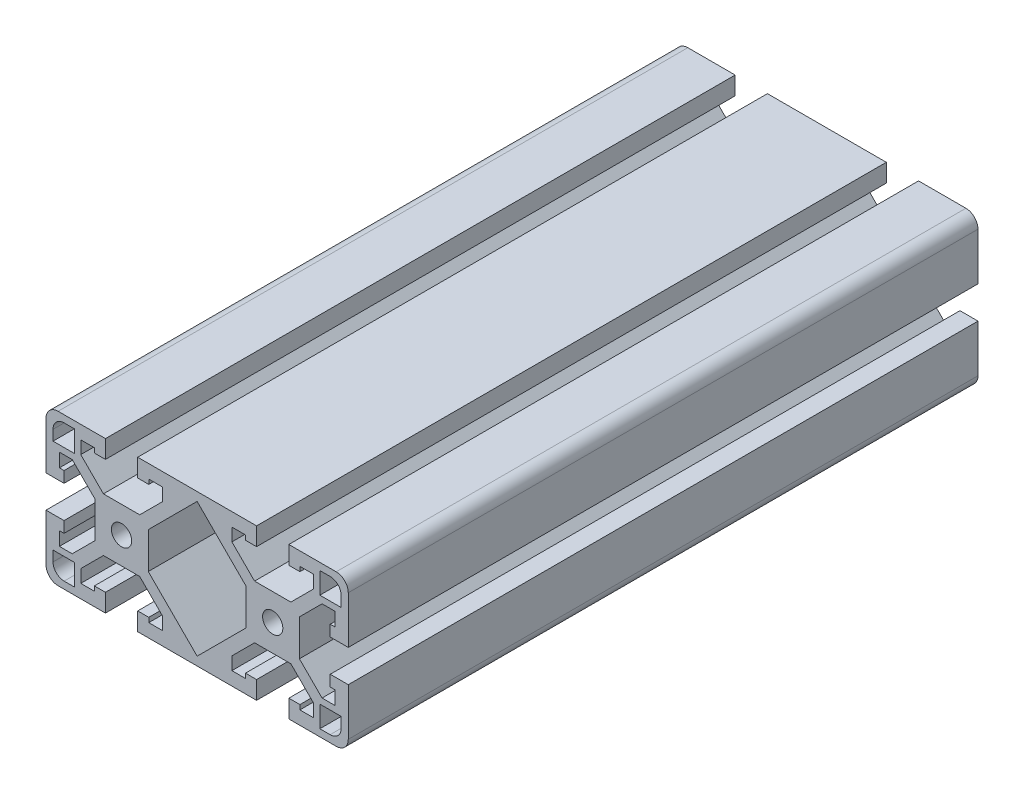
from build123d import *

# Parameters (mm, degrees)
SKETCH1_R           = 2.5527
BOSS_EXTRUDE1_DEPTH = 79.375


with BuildPart() as part:
    # Sketch1 → Boss-Extrude1 (new, symmetric)
    with BuildSketch(Plane.XY):
        with BuildLine():
            Line((-29.337, 12.442261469), (-29.337, 15.6718))
            Line((-29.337, 15.6718), (-25.908, 15.6718))
            Line((-25.908, 15.6718), (-25.908, 14.5034))
            Line((-25.908, 14.5034), (-23.114, 14.5034))
            Line((-23.114, 14.5034), (-23.114, 19.05))
            Line((-23.114, 19.05), (-35.052, 19.05))
            ThreePointArc((-35.052, 19.05), (-37.207261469, 18.157261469), (-38.1, 16.002))
            Line((-38.1, 16.002), (-38.1, 4.064))
            Line((-38.1, 4.064), (-33.5534, 4.064))
            Line((-33.5534, 4.064), (-33.5534, 6.858))
            Line((-33.5534, 6.858), (-34.7218, 6.858))
            Line((-34.7218, 6.858), (-34.7218, 10.287))
            Line((-34.7218, 10.287), (-31.492261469, 10.287))
            Line((-31.492261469, 10.287), (-25.781, 4.575738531))
            Line((-25.781, 4.575738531), (-25.781, -4.575738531))
            Line((-25.781, -4.575738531), (-31.492261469, -10.287))
            Line((-31.492261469, -10.287), (-34.7218, -10.287))
            Line((-34.7218, -10.287), (-34.7218, -6.858))
            Line((-34.7218, -6.858), (-33.5534, -6.858))
            Line((-33.5534, -6.858), (-33.5534, -4.064))
            Line((-33.5534, -4.064), (-38.1, -4.064))
            Line((-38.1, -4.064), (-38.1, -16.002))
            ThreePointArc((-38.1, -16.002), (-37.207261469, -18.157261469), (-35.052, -19.05))
            Line((-35.052, -19.05), (-23.114, -19.05))
            Line((-23.114, -19.05), (-23.114, -14.5034))
            Line((-23.114, -14.5034), (-25.908, -14.5034))
            Line((-25.908, -14.5034), (-25.908, -15.6718))
            Line((-25.908, -15.6718), (-29.337, -15.6718))
            Line((-29.337, -15.6718), (-29.337, -12.442261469))
            Line((-29.337, -12.442261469), (-23.625738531, -6.731))
            Line((-23.625738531, -6.731), (-14.474261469, -6.731))
            Line((-14.474261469, -6.731), (-8.763, -12.442261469))
            Line((-8.763, -12.442261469), (-8.763, -15.6718))
            Line((-8.763, -15.6718), (-12.192, -15.6718))
            Line((-12.192, -15.6718), (-12.192, -14.5034))
            Line((-12.192, -14.5034), (-14.986, -14.5034))
            Line((-14.986, -14.5034), (-14.986, -19.05))
            Line((-14.986, -19.05), (14.986, -19.05))
            Line((14.986, -19.05), (14.986, -14.5034))
            Line((14.986, -14.5034), (12.192, -14.5034))
            Line((12.192, -14.5034), (12.192, -15.6718))
            Line((12.192, -15.6718), (8.763, -15.6718))
            Line((8.763, -15.6718), (8.763, -12.442261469))
            Line((8.763, -12.442261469), (14.474261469, -6.731))
            Line((14.474261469, -6.731), (23.625738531, -6.731))
            Line((23.625738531, -6.731), (29.337, -12.442261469))
            Line((29.337, -12.442261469), (29.337, -15.6718))
            Line((29.337, -15.6718), (25.908, -15.6718))
            Line((25.908, -15.6718), (25.908, -14.5034))
            Line((25.908, -14.5034), (23.114, -14.5034))
            Line((23.114, -14.5034), (23.114, -19.05))
            Line((23.114, -19.05), (35.052, -19.05))
            ThreePointArc((35.052, -19.05), (37.207261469, -18.157261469), (38.1, -16.002))
            Line((38.1, -16.002), (38.1, -4.064))
            Line((38.1, -4.064), (33.5534, -4.064))
            Line((33.5534, -4.064), (33.5534, -6.858))
            Line((33.5534, -6.858), (34.7218, -6.858))
            Line((34.7218, -6.858), (34.7218, -10.287))
            Line((34.7218, -10.287), (31.492261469, -10.287))
            Line((31.492261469, -10.287), (25.781, -4.575738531))
            Line((25.781, -4.575738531), (25.781, 4.575738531))
            Line((25.781, 4.575738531), (31.492261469, 10.287))
            Line((31.492261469, 10.287), (34.7218, 10.287))
            Line((34.7218, 10.287), (34.7218, 6.858))
            Line((34.7218, 6.858), (33.5534, 6.858))
            Line((33.5534, 6.858), (33.5534, 4.064))
            Line((33.5534, 4.064), (38.1, 4.064))
            Line((38.1, 4.064), (38.1, 16.002))
            ThreePointArc((38.1, 16.002), (37.207261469, 18.157261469), (35.052, 19.05))
            Line((35.052, 19.05), (23.114, 19.05))
            Line((23.114, 19.05), (23.114, 14.5034))
            Line((23.114, 14.5034), (25.908, 14.5034))
            Line((25.908, 14.5034), (25.908, 15.6718))
            Line((25.908, 15.6718), (29.337, 15.6718))
            Line((29.337, 15.6718), (29.337, 12.442261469))
            Line((29.337, 12.442261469), (23.625738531, 6.731))
            Line((23.625738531, 6.731), (14.474261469, 6.731))
            Line((14.474261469, 6.731), (8.763, 12.442261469))
            Line((8.763, 12.442261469), (8.763, 15.6718))
            Line((8.763, 15.6718), (12.192, 15.6718))
            Line((12.192, 15.6718), (12.192, 14.5034))
            Line((12.192, 14.5034), (14.986, 14.5034))
            Line((14.986, 14.5034), (14.986, 19.05))
            Line((14.986, 19.05), (-14.986, 19.05))
            Line((-14.986, 19.05), (-14.986, 14.5034))
            Line((-14.986, 14.5034), (-12.192, 14.5034))
            Line((-12.192, 14.5034), (-12.192, 15.6718))
            Line((-12.192, 15.6718), (-8.763, 15.6718))
            Line((-8.763, 15.6718), (-8.763, 12.442261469))
            Line((-8.763, 12.442261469), (-14.474261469, 6.731))
            Line((-14.474261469, 6.731), (-23.625738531, 6.731))
            Line((-23.625738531, 6.731), (-29.337, 12.442261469))
        make_face()
        with Locations(Location((-19.05, 0, 0), (0, 0, 180))):
            Circle(SKETCH1_R, mode=Mode.SUBTRACT)
        with Locations(Location((19.05, 0, 0), (0, 0, 180))):
            Circle(SKETCH1_R, mode=Mode.SUBTRACT)
        Polygon((-12.319, 4.575738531), (-12.319, -4.575738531), (0, -16.894738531), (12.319, -4.575738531), (12.319, 4.575738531), (0, 16.894738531), align=None, mode=Mode.SUBTRACT)
        with BuildLine():
            Line((-30.9372, 11.8872), (-30.9372, 17.272))
            Line((-30.9372, 17.272), (-33.528, 17.272))
            ThreePointArc((-33.528, 17.272), (-35.503656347, 16.453656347), (-36.322, 14.478))
            Line((-36.322, 14.478), (-36.322, 11.8872))
            Line((-36.322, 11.8872), (-30.9372, 11.8872))
        make_face(mode=Mode.SUBTRACT)
        with BuildLine():
            Line((-30.9372, -17.272), (-30.9372, -11.8872))
            Line((-30.9372, -11.8872), (-36.322, -11.8872))
            Line((-36.322, -11.8872), (-36.322, -14.478))
            ThreePointArc((-36.322, -14.478), (-35.503656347, -16.453656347), (-33.528, -17.272))
            Line((-33.528, -17.272), (-30.9372, -17.272))
        make_face(mode=Mode.SUBTRACT)
        with BuildLine():
            Line((36.322, -11.8872), (30.9372, -11.8872))
            Line((30.9372, -11.8872), (30.9372, -17.272))
            Line((30.9372, -17.272), (33.528, -17.272))
            ThreePointArc((33.528, -17.272), (35.503656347, -16.453656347), (36.322, -14.478))
            Line((36.322, -14.478), (36.322, -11.8872))
        make_face(mode=Mode.SUBTRACT)
        with BuildLine():
            Line((30.9372, 17.272), (30.9372, 11.8872))
            Line((30.9372, 11.8872), (36.322, 11.8872))
            Line((36.322, 11.8872), (36.322, 14.478))
            ThreePointArc((36.322, 14.478), (35.503656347, 16.453656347), (33.528, 17.272))
            Line((33.528, 17.272), (30.9372, 17.272))
        make_face(mode=Mode.SUBTRACT)
    extrude(amount=BOSS_EXTRUDE1_DEPTH, both=True)


solid = part.part
